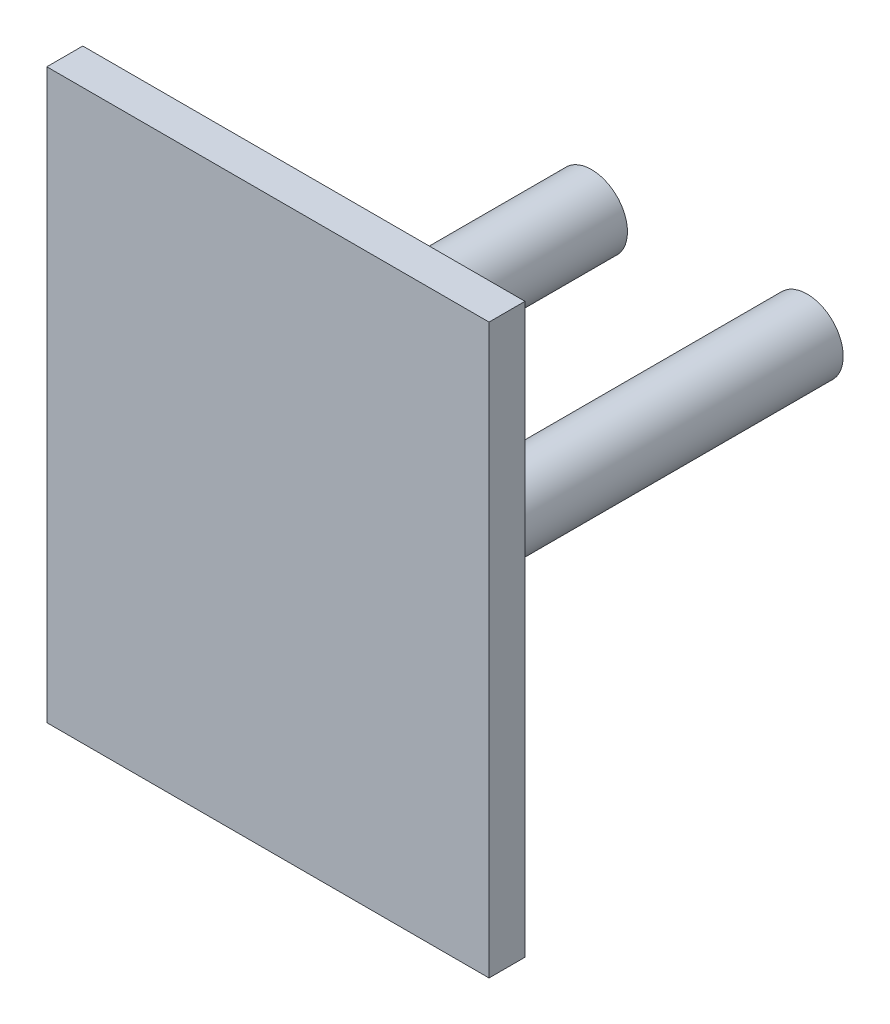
ISO-10303-21;
HEADER;
FILE_DESCRIPTION(('STEP AP214'),'2;1');
FILE_NAME('part.step','',(''),(''),'','','');
FILE_SCHEMA(('AUTOMOTIVE_DESIGN { 1 0 10303 214 1 1 1 1 }'));
ENDSEC;
DATA;
#1=APPLICATION_CONTEXT('core data for automotive mechanical design processes');
#2=APPLICATION_PROTOCOL_DEFINITION('international standard','automotive_design',2000,#1);
#3=PRODUCT_CONTEXT('',#1,'mechanical');
#4=PRODUCT('Part','Part','',(#3));
#5=PRODUCT_RELATED_PRODUCT_CATEGORY('part','',(#4));
#6=PRODUCT_DEFINITION_FORMATION('','',#4);
#7=PRODUCT_DEFINITION_CONTEXT('part definition',#1,'design');
#8=PRODUCT_DEFINITION('design','',#6,#7);
#9=PRODUCT_DEFINITION_SHAPE('','',#8);
#10=(LENGTH_UNIT() NAMED_UNIT(*) SI_UNIT(.MILLI.,.METRE.));
#11=(NAMED_UNIT(*) PLANE_ANGLE_UNIT() SI_UNIT($,.RADIAN.));
#12=(NAMED_UNIT(*) SI_UNIT($,.STERADIAN.) SOLID_ANGLE_UNIT());
#13=UNCERTAINTY_MEASURE_WITH_UNIT(LENGTH_MEASURE(1.E-05),#10,'distance_accuracy_value','');
#14=(GEOMETRIC_REPRESENTATION_CONTEXT(3) GLOBAL_UNCERTAINTY_ASSIGNED_CONTEXT((#13)) GLOBAL_UNIT_ASSIGNED_CONTEXT((#10,
#11,#12)) REPRESENTATION_CONTEXT('',''));
#15=CARTESIAN_POINT('',(0.,0.,0.));
#16=DIRECTION('',(0.,0.,1.));
#17=DIRECTION('',(1.,0.,0.));
#18=AXIS2_PLACEMENT_3D('',#15,#16,#17);
#19=CARTESIAN_POINT('',(61.5,-79.,10.));
#20=DIRECTION('',(-1.,0.,0.));
#21=DIRECTION('',(0.,-1.,0.));
#22=AXIS2_PLACEMENT_3D('',#19,#20,#21);
#23=PLANE('',#22);
#24=DIRECTION('',(0.,1.,0.));
#25=VECTOR('',#24,1.);
#26=CARTESIAN_POINT('',(61.5,-79.,0.));
#27=LINE('',#26,#25);
#28=CARTESIAN_POINT('',(61.5,-79.,0.));
#29=VERTEX_POINT('',#28);
#30=CARTESIAN_POINT('',(61.5,79.,0.));
#31=VERTEX_POINT('',#30);
#32=EDGE_CURVE('E80',#29,#31,#27,.T.);
#33=ORIENTED_EDGE('',*,*,#32,.T.);
#34=DIRECTION('',(0.,0.,-1.));
#35=VECTOR('',#34,1.);
#36=CARTESIAN_POINT('',(61.5,79.,10.));
#37=LINE('',#36,#35);
#38=CARTESIAN_POINT('',(61.5,79.,10.));
#39=VERTEX_POINT('',#38);
#40=EDGE_CURVE('E11',#39,#31,#37,.T.);
#41=ORIENTED_EDGE('',*,*,#40,.F.);
#42=DIRECTION('',(0.,1.,0.));
#43=VECTOR('',#42,1.);
#44=CARTESIAN_POINT('',(61.5,-79.,10.));
#45=LINE('',#44,#43);
#46=CARTESIAN_POINT('',(61.5,-79.,10.));
#47=VERTEX_POINT('',#46);
#48=EDGE_CURVE('E105',#47,#39,#45,.T.);
#49=ORIENTED_EDGE('',*,*,#48,.F.);
#50=DIRECTION('',(0.,0.,-1.));
#51=VECTOR('',#50,1.);
#52=CARTESIAN_POINT('',(61.5,-79.,10.));
#53=LINE('',#52,#51);
#54=EDGE_CURVE('E93',#47,#29,#53,.T.);
#55=ORIENTED_EDGE('',*,*,#54,.T.);
#56=EDGE_LOOP('',(#33,#41,#49,#55));
#57=FACE_BOUND('',#56,.T.);
#58=ADVANCED_FACE('F35',(#57),#23,.F.);
#59=CARTESIAN_POINT('',(0.,79.,10.));
#60=DIRECTION('',(0.,-1.,0.));
#61=DIRECTION('',(1.,0.,0.));
#62=AXIS2_PLACEMENT_3D('',#59,#60,#61);
#63=PLANE('',#62);
#64=DIRECTION('',(-1.,0.,0.));
#65=VECTOR('',#64,1.);
#66=CARTESIAN_POINT('',(0.,79.,0.));
#67=LINE('',#66,#65);
#68=CARTESIAN_POINT('',(-61.5,79.,0.));
#69=VERTEX_POINT('',#68);
#70=EDGE_CURVE('E77',#31,#69,#67,.T.);
#71=ORIENTED_EDGE('',*,*,#70,.T.);
#72=DIRECTION('',(0.,0.,-1.));
#73=VECTOR('',#72,1.);
#74=CARTESIAN_POINT('',(-61.5,79.,10.));
#75=LINE('',#74,#73);
#76=CARTESIAN_POINT('',(-61.5,79.,10.));
#77=VERTEX_POINT('',#76);
#78=EDGE_CURVE('E43',#77,#69,#75,.T.);
#79=ORIENTED_EDGE('',*,*,#78,.F.);
#80=DIRECTION('',(-1.,0.,0.));
#81=VECTOR('',#80,1.);
#82=CARTESIAN_POINT('',(0.,79.,10.));
#83=LINE('',#82,#81);
#84=EDGE_CURVE('E89',#39,#77,#83,.T.);
#85=ORIENTED_EDGE('',*,*,#84,.F.);
#86=ORIENTED_EDGE('',*,*,#40,.T.);
#87=EDGE_LOOP('',(#71,#79,#85,#86));
#88=FACE_BOUND('',#87,.T.);
#89=ADVANCED_FACE('F88',(#88),#63,.F.);
#90=CARTESIAN_POINT('',(-61.5,-79.,10.));
#91=DIRECTION('',(1.,0.,0.));
#92=DIRECTION('',(0.,0.,-1.));
#93=AXIS2_PLACEMENT_3D('',#90,#91,#92);
#94=PLANE('',#93);
#95=DIRECTION('',(0.,-1.,0.));
#96=VECTOR('',#95,1.);
#97=CARTESIAN_POINT('',(-61.5,-79.,0.));
#98=LINE('',#97,#96);
#99=CARTESIAN_POINT('',(-61.5,-79.,0.));
#100=VERTEX_POINT('',#99);
#101=EDGE_CURVE('E82',#69,#100,#98,.T.);
#102=ORIENTED_EDGE('',*,*,#101,.T.);
#103=DIRECTION('',(0.,0.,-1.));
#104=VECTOR('',#103,1.);
#105=CARTESIAN_POINT('',(-61.5,-79.,10.));
#106=LINE('',#105,#104);
#107=CARTESIAN_POINT('',(-61.5,-79.,10.));
#108=VERTEX_POINT('',#107);
#109=EDGE_CURVE('E111',#108,#100,#106,.T.);
#110=ORIENTED_EDGE('',*,*,#109,.F.);
#111=DIRECTION('',(0.,-1.,0.));
#112=VECTOR('',#111,1.);
#113=CARTESIAN_POINT('',(-61.5,-79.,10.));
#114=LINE('',#113,#112);
#115=EDGE_CURVE('E56',#77,#108,#114,.T.);
#116=ORIENTED_EDGE('',*,*,#115,.F.);
#117=ORIENTED_EDGE('',*,*,#78,.T.);
#118=EDGE_LOOP('',(#102,#110,#116,#117));
#119=FACE_BOUND('',#118,.T.);
#120=ADVANCED_FACE('F115',(#119),#94,.F.);
#121=CARTESIAN_POINT('',(0.,-79.,10.));
#122=DIRECTION('',(0.,1.,0.));
#123=DIRECTION('',(0.,0.,1.));
#124=AXIS2_PLACEMENT_3D('',#121,#122,#123);
#125=PLANE('',#124);
#126=DIRECTION('',(1.,0.,0.));
#127=VECTOR('',#126,1.);
#128=CARTESIAN_POINT('',(0.,-79.,0.));
#129=LINE('',#128,#127);
#130=EDGE_CURVE('E103',#100,#29,#129,.T.);
#131=ORIENTED_EDGE('',*,*,#130,.T.);
#132=ORIENTED_EDGE('',*,*,#54,.F.);
#133=DIRECTION('',(1.,0.,0.));
#134=VECTOR('',#133,1.);
#135=CARTESIAN_POINT('',(0.,-79.,10.));
#136=LINE('',#135,#134);
#137=EDGE_CURVE('E51',#108,#47,#136,.T.);
#138=ORIENTED_EDGE('',*,*,#137,.F.);
#139=ORIENTED_EDGE('',*,*,#109,.T.);
#140=EDGE_LOOP('',(#131,#132,#138,#139));
#141=FACE_BOUND('',#140,.T.);
#142=ADVANCED_FACE('F117',(#141),#125,.F.);
#143=CARTESIAN_POINT('',(61.5,-79.,10.));
#144=DIRECTION('',(0.,0.,1.));
#145=DIRECTION('',(1.,0.,0.));
#146=AXIS2_PLACEMENT_3D('',#143,#144,#145);
#147=PLANE('',#146);
#148=ORIENTED_EDGE('',*,*,#48,.T.);
#149=ORIENTED_EDGE('',*,*,#84,.T.);
#150=ORIENTED_EDGE('',*,*,#115,.T.);
#151=ORIENTED_EDGE('',*,*,#137,.T.);
#152=EDGE_LOOP('',(#148,#149,#150,#151));
#153=FACE_BOUND('',#152,.T.);
#154=ADVANCED_FACE('F118',(#153),#147,.T.);
#155=CARTESIAN_POINT('',(61.5,-79.,0.));
#156=DIRECTION('',(0.,0.,1.));
#157=DIRECTION('',(1.,0.,0.));
#158=AXIS2_PLACEMENT_3D('',#155,#156,#157);
#159=PLANE('',#158);
#160=CARTESIAN_POINT('',(-30.,0.,0.));
#161=DIRECTION('',(0.,0.,1.));
#162=DIRECTION('',(1.,0.,0.));
#163=AXIS2_PLACEMENT_3D('',#160,#161,#162);
#164=CIRCLE('',#163,10.);
#165=CARTESIAN_POINT('',(-20.,0.,0.));
#166=VERTEX_POINT('',#165);
#167=EDGE_CURVE('E38',#166,#166,#164,.T.);
#168=ORIENTED_EDGE('',*,*,#167,.T.);
#169=EDGE_LOOP('',(#168));
#170=FACE_BOUND('',#169,.T.);
#171=CARTESIAN_POINT('',(30.,0.,0.));
#172=DIRECTION('',(0.,0.,1.));
#173=DIRECTION('',(1.,0.,0.));
#174=AXIS2_PLACEMENT_3D('',#171,#172,#173);
#175=CIRCLE('',#174,10.);
#176=CARTESIAN_POINT('',(40.,0.,0.));
#177=VERTEX_POINT('',#176);
#178=EDGE_CURVE('E94',#177,#177,#175,.T.);
#179=ORIENTED_EDGE('',*,*,#178,.T.);
#180=EDGE_LOOP('',(#179));
#181=FACE_BOUND('',#180,.T.);
#182=ORIENTED_EDGE('',*,*,#32,.F.);
#183=ORIENTED_EDGE('',*,*,#130,.F.);
#184=ORIENTED_EDGE('',*,*,#101,.F.);
#185=ORIENTED_EDGE('',*,*,#70,.F.);
#186=EDGE_LOOP('',(#182,#183,#184,#185));
#187=FACE_BOUND('',#186,.T.);
#188=ADVANCED_FACE('F78',(#170,#181,#187),#159,.F.);
#189=CARTESIAN_POINT('',(30.,0.,-110.));
#190=DIRECTION('',(0.,0.,1.));
#191=DIRECTION('',(1.,0.,0.));
#192=AXIS2_PLACEMENT_3D('',#189,#190,#191);
#193=CYLINDRICAL_SURFACE('',#192,10.);
#194=CARTESIAN_POINT('',(30.,0.,-110.));
#195=DIRECTION('',(0.,0.,1.));
#196=DIRECTION('',(1.,0.,0.));
#197=AXIS2_PLACEMENT_3D('',#194,#195,#196);
#198=CIRCLE('',#197,10.);
#199=CARTESIAN_POINT('',(40.,0.,-110.));
#200=VERTEX_POINT('',#199);
#201=EDGE_CURVE('E98',#200,#200,#198,.T.);
#202=ORIENTED_EDGE('',*,*,#201,.T.);
#203=EDGE_LOOP('',(#202));
#204=FACE_BOUND('',#203,.T.);
#205=ORIENTED_EDGE('',*,*,#178,.F.);
#206=EDGE_LOOP('',(#205));
#207=FACE_BOUND('',#206,.T.);
#208=ADVANCED_FACE('F125',(#204,#207),#193,.T.);
#209=CARTESIAN_POINT('',(30.,0.,-110.));
#210=DIRECTION('',(0.,0.,1.));
#211=DIRECTION('',(1.,0.,0.));
#212=AXIS2_PLACEMENT_3D('',#209,#210,#211);
#213=PLANE('',#212);
#214=ORIENTED_EDGE('',*,*,#201,.F.);
#215=EDGE_LOOP('',(#214));
#216=FACE_BOUND('',#215,.T.);
#217=ADVANCED_FACE('F164',(#216),#213,.F.);
#218=CARTESIAN_POINT('',(-30.,0.,-110.));
#219=DIRECTION('',(0.,0.,1.));
#220=DIRECTION('',(1.,0.,0.));
#221=AXIS2_PLACEMENT_3D('',#218,#219,#220);
#222=CYLINDRICAL_SURFACE('',#221,10.);
#223=CARTESIAN_POINT('',(-30.,0.,-110.));
#224=DIRECTION('',(0.,0.,1.));
#225=DIRECTION('',(-1.,0.,0.));
#226=AXIS2_PLACEMENT_3D('',#223,#224,#225);
#227=CIRCLE('',#226,10.);
#228=CARTESIAN_POINT('',(-40.,0.,-110.));
#229=VERTEX_POINT('',#228);
#230=EDGE_CURVE('E200',#229,#229,#227,.T.);
#231=ORIENTED_EDGE('',*,*,#230,.T.);
#232=EDGE_LOOP('',(#231));
#233=FACE_BOUND('',#232,.T.);
#234=ORIENTED_EDGE('',*,*,#167,.F.);
#235=EDGE_LOOP('',(#234));
#236=FACE_BOUND('',#235,.T.);
#237=ADVANCED_FACE('F174',(#233,#236),#222,.T.);
#238=CARTESIAN_POINT('',(-30.,0.,-110.));
#239=DIRECTION('',(0.,0.,-1.));
#240=DIRECTION('',(-1.,0.,0.));
#241=AXIS2_PLACEMENT_3D('',#238,#239,#240);
#242=PLANE('',#241);
#243=ORIENTED_EDGE('',*,*,#230,.F.);
#244=EDGE_LOOP('',(#243));
#245=FACE_BOUND('',#244,.T.);
#246=ADVANCED_FACE('F184',(#245),#242,.T.);
#247=CLOSED_SHELL('',(#58,#89,#120,#142,#154,#188,#208,#217,#237,#246));
#248=MANIFOLD_SOLID_BREP('B2',#247);
#249=ADVANCED_BREP_SHAPE_REPRESENTATION('',(#18,#248),#14);
#250=SHAPE_DEFINITION_REPRESENTATION(#9,#249);
ENDSEC;
END-ISO-10303-21;
